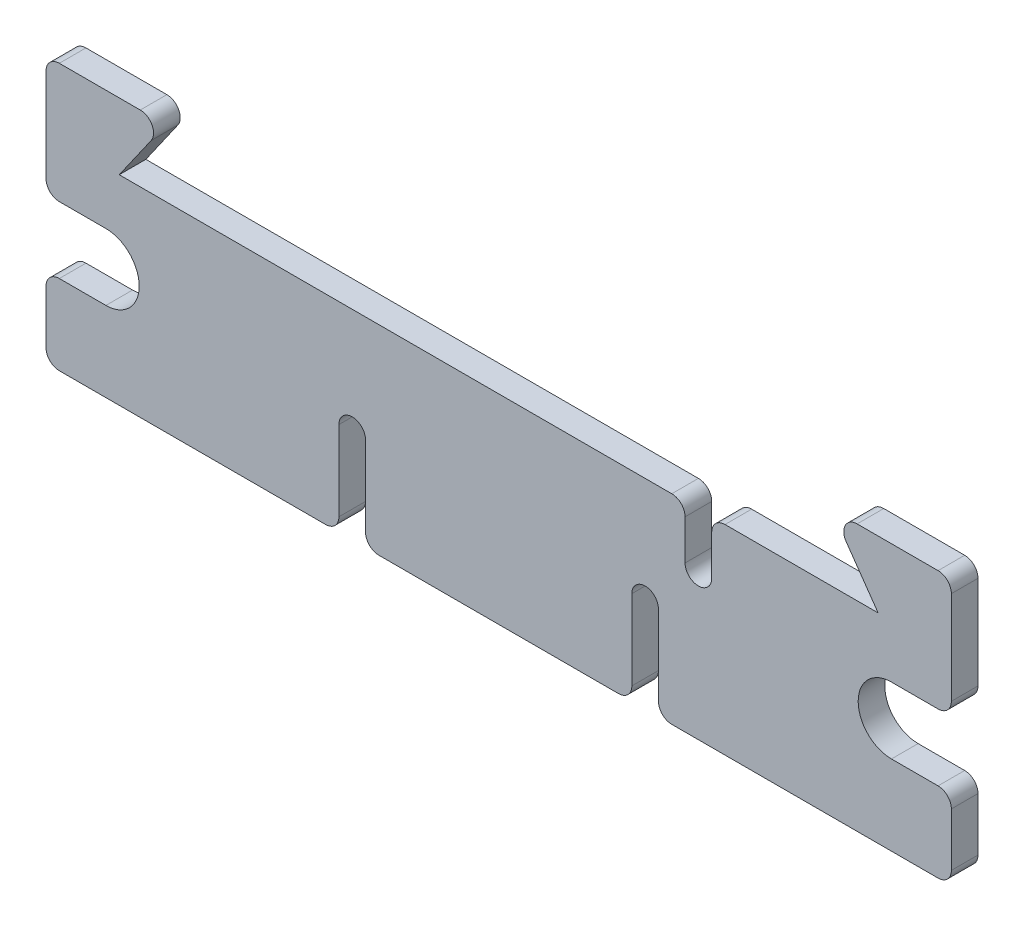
from build123d import *

# Parameters (mm, degrees)
RESSALTO_EXTRUS_O1_DEPTH = 2


with BuildPart() as part:
    # Esbo_o1 → Ressalto-extrus_o1 (new body)
    with BuildSketch(Plane.XY):
        with BuildLine():
            Line((-28.5, 0), (13, 0))
            ThreePointArc((13, 0), (13.707106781, -0.292893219), (14, -1))
            Line((14, -1), (14, -4))
            ThreePointArc((14, -4), (15, -5), (16, -4))
            Line((16, -4), (16, -1))
            ThreePointArc((16, -1), (16.292893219, -0.292893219), (17, 0))
            Line((17, 0), (28.5, 0))
            Line((28.5, 0), (26.101423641, 3.426537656))
            ThreePointArc((26.101423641, 3.426537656), (26.033676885, 4.461810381), (26.920655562, 5))
            Line((26.920655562, 5), (33, 5))
            ThreePointArc((33, 5), (33.707106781, 4.707106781), (34, 4))
            Line((34, 4), (34, -3))
            ThreePointArc((34, -3), (33.707106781, -3.707106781), (33, -4))
            Line((33, -4), (29.5, -4))
            ThreePointArc((29.5, -4), (27, -6.5), (29.5, -9))
            Line((29.5, -9), (33, -9))
            ThreePointArc((33, -9), (33.707106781, -9.292893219), (34, -10))
            Line((34, -10), (34, -14))
            ThreePointArc((34, -14), (33.707106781, -14.707106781), (33, -15))
            Line((33, -15), (13, -15))
            ThreePointArc((13, -15), (12.292893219, -14.707106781), (12, -14))
            Line((12, -14), (12, -8))
            ThreePointArc((12, -8), (11, -7), (10, -8))
            Line((10, -8), (10, -14))
            ThreePointArc((10, -14), (9.707106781, -14.707106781), (9, -15))
            Line((9, -15), (-9, -15))
            ThreePointArc((-9, -15), (-9.707106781, -14.707106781), (-10, -14))
            Line((-10, -14), (-10, -8))
            ThreePointArc((-10, -8), (-11, -7), (-12, -8))
            Line((-12, -8), (-12, -14))
            ThreePointArc((-12, -14), (-12.292893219, -14.707106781), (-13, -15))
            Line((-13, -15), (-33, -15))
            ThreePointArc((-33, -15), (-33.707106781, -14.707106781), (-34, -14))
            Line((-34, -14), (-34, -10))
            ThreePointArc((-34, -10), (-33.707106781, -9.292893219), (-33, -9))
            Line((-33, -9), (-29.5, -9))
            ThreePointArc((-29.5, -9), (-27, -6.5), (-29.5, -4))
            Line((-29.5, -4), (-33, -4))
            ThreePointArc((-33, -4), (-33.707106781, -3.707106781), (-34, -3))
            Line((-34, -3), (-34, 4))
            ThreePointArc((-34, 4), (-33.707106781, 4.707106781), (-33, 5))
            Line((-33, 5), (-26.920655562, 5))
            ThreePointArc((-26.920655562, 5), (-26.033676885, 4.461810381), (-26.101423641, 3.426537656))
            Line((-26.101423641, 3.426537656), (-28.5, 0))
        make_face()
    extrude(amount=RESSALTO_EXTRUS_O1_DEPTH)


solid = part.part
